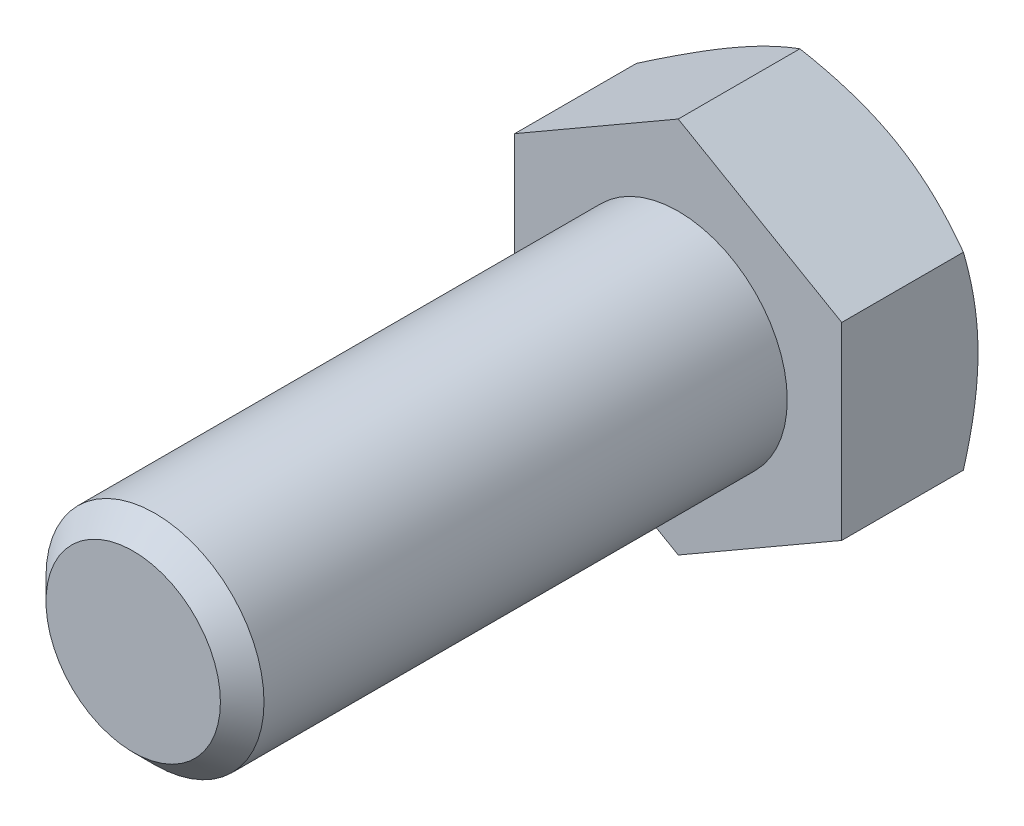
ISO-10303-21;
HEADER;
FILE_DESCRIPTION(('STEP AP214'),'2;1');
FILE_NAME('part.step','',(''),(''),'','','');
FILE_SCHEMA(('AUTOMOTIVE_DESIGN { 1 0 10303 214 1 1 1 1 }'));
ENDSEC;
DATA;
#1=APPLICATION_CONTEXT('core data for automotive mechanical design processes');
#2=APPLICATION_PROTOCOL_DEFINITION('international standard','automotive_design',2000,#1);
#3=PRODUCT_CONTEXT('',#1,'mechanical');
#4=PRODUCT('Part','Part','',(#3));
#5=PRODUCT_RELATED_PRODUCT_CATEGORY('part','',(#4));
#6=PRODUCT_DEFINITION_FORMATION('','',#4);
#7=PRODUCT_DEFINITION_CONTEXT('part definition',#1,'design');
#8=PRODUCT_DEFINITION('design','',#6,#7);
#9=PRODUCT_DEFINITION_SHAPE('','',#8);
#10=(LENGTH_UNIT() NAMED_UNIT(*) SI_UNIT(.MILLI.,.METRE.));
#11=(NAMED_UNIT(*) PLANE_ANGLE_UNIT() SI_UNIT($,.RADIAN.));
#12=(NAMED_UNIT(*) SI_UNIT($,.STERADIAN.) SOLID_ANGLE_UNIT());
#13=UNCERTAINTY_MEASURE_WITH_UNIT(LENGTH_MEASURE(1.E-05),#10,'distance_accuracy_value','');
#14=(GEOMETRIC_REPRESENTATION_CONTEXT(3) GLOBAL_UNCERTAINTY_ASSIGNED_CONTEXT((#13)) GLOBAL_UNIT_ASSIGNED_CONTEXT((#10,
#11,#12)) REPRESENTATION_CONTEXT('',''));
#15=CARTESIAN_POINT('',(0.,0.,0.));
#16=DIRECTION('',(0.,0.,1.));
#17=DIRECTION('',(1.,0.,0.));
#18=AXIS2_PLACEMENT_3D('',#15,#16,#17);
#19=CARTESIAN_POINT('',(-1.17961196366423E-13,3.05311331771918E-13,39.9999999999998));
#20=DIRECTION('',(0.,0.,0.999999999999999));
#21=DIRECTION('',(1.,0.,0.));
#22=AXIS2_PLACEMENT_3D('',#19,#20,#21);
#23=PLANE('',#22);
#24=CARTESIAN_POINT('',(-1.17961196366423E-13,3.05311331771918E-13,39.9999999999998));
#25=DIRECTION('',(0.,0.,0.999999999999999));
#26=DIRECTION('',(1.,0.,0.));
#27=AXIS2_PLACEMENT_3D('',#24,#25,#26);
#28=CIRCLE('',#27,6.4);
#29=CARTESIAN_POINT('',(6.3999999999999,3.13837844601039E-13,39.9999999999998));
#30=VERTEX_POINT('',#29);
#31=EDGE_CURVE('E206',#30,#30,#28,.T.);
#32=ORIENTED_EDGE('',*,*,#31,.T.);
#33=EDGE_LOOP('',(#32));
#34=FACE_BOUND('',#33,.T.);
#35=ADVANCED_FACE('F32',(#34),#23,.T.);
#36=CARTESIAN_POINT('',(0.,0.,0.));
#37=DIRECTION('',(0.,0.,0.999999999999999));
#38=DIRECTION('',(1.,0.,0.));
#39=AXIS2_PLACEMENT_3D('',#36,#37,#38);
#40=CYLINDRICAL_SURFACE('',#39,8.);
#41=CARTESIAN_POINT('',(0.,3.60822483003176E-13,38.3999999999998));
#42=DIRECTION('',(0.,0.,0.999999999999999));
#43=DIRECTION('',(1.,0.,0.));
#44=AXIS2_PLACEMENT_3D('',#41,#42,#43);
#45=CIRCLE('',#44,8.);
#46=CARTESIAN_POINT('',(8.,0.,38.3999999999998));
#47=VERTEX_POINT('',#46);
#48=EDGE_CURVE('E208',#47,#47,#45,.F.);
#49=CARTESIAN_POINT('',(0.,0.,0.));
#50=DIRECTION('',(0.,0.,0.999999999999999));
#51=DIRECTION('',(1.,0.,0.));
#52=AXIS2_PLACEMENT_3D('',#49,#50,#51);
#53=CIRCLE('',#52,8.);
#54=CARTESIAN_POINT('',(8.00000000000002,0.,0.));
#55=VERTEX_POINT('',#54);
#56=EDGE_CURVE('E209',#55,#55,#53,.F.);
#57=CARTESIAN_POINT('',(8.,0.,38.3999999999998));
#58=CARTESIAN_POINT('',(8.,0.,37.9999999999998));
#59=CARTESIAN_POINT('',(8.,0.,37.5999999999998));
#60=CARTESIAN_POINT('',(8.,0.,36.7999999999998));
#61=CARTESIAN_POINT('',(8.,0.,36.3999999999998));
#62=CARTESIAN_POINT('',(8.,0.,35.5999999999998));
#63=CARTESIAN_POINT('',(8.,0.,35.1999999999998));
#64=CARTESIAN_POINT('',(8.,0.,34.3999999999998));
#65=CARTESIAN_POINT('',(8.,0.,33.9999999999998));
#66=CARTESIAN_POINT('',(8.,0.,33.1999999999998));
#67=CARTESIAN_POINT('',(8.,0.,32.7999999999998));
#68=CARTESIAN_POINT('',(8.,0.,31.9999999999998));
#69=CARTESIAN_POINT('',(8.,0.,31.5999999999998));
#70=CARTESIAN_POINT('',(8.,0.,30.7999999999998));
#71=CARTESIAN_POINT('',(8.,0.,30.3999999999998));
#72=CARTESIAN_POINT('',(8.,0.,29.5999999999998));
#73=CARTESIAN_POINT('',(8.,0.,29.1999999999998));
#74=CARTESIAN_POINT('',(8.,0.,28.3999999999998));
#75=CARTESIAN_POINT('',(8.00000000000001,0.,27.9999999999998));
#76=CARTESIAN_POINT('',(8.00000000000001,0.,27.1999999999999));
#77=CARTESIAN_POINT('',(8.00000000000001,0.,26.7999999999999));
#78=CARTESIAN_POINT('',(8.00000000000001,0.,25.9999999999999));
#79=CARTESIAN_POINT('',(8.00000000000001,0.,25.5999999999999));
#80=CARTESIAN_POINT('',(8.00000000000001,0.,24.7999999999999));
#81=CARTESIAN_POINT('',(8.00000000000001,0.,24.3999999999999));
#82=CARTESIAN_POINT('',(8.00000000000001,0.,23.5999999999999));
#83=CARTESIAN_POINT('',(8.00000000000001,0.,23.1999999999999));
#84=CARTESIAN_POINT('',(8.00000000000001,0.,22.3999999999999));
#85=CARTESIAN_POINT('',(8.00000000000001,0.,21.9999999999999));
#86=CARTESIAN_POINT('',(8.00000000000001,0.,21.1999999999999));
#87=CARTESIAN_POINT('',(8.00000000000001,0.,20.7999999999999));
#88=CARTESIAN_POINT('',(8.00000000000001,0.,19.9999999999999));
#89=CARTESIAN_POINT('',(8.00000000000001,0.,19.5999999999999));
#90=CARTESIAN_POINT('',(8.00000000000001,0.,18.7999999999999));
#91=CARTESIAN_POINT('',(8.00000000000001,0.,18.3999999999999));
#92=CARTESIAN_POINT('',(8.00000000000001,0.,17.5999999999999));
#93=CARTESIAN_POINT('',(8.00000000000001,0.,17.1999999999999));
#94=CARTESIAN_POINT('',(8.00000000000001,0.,16.3999999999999));
#95=CARTESIAN_POINT('',(8.00000000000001,0.,15.9999999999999));
#96=CARTESIAN_POINT('',(8.00000000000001,0.,15.1999999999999));
#97=CARTESIAN_POINT('',(8.00000000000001,0.,14.7999999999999));
#98=CARTESIAN_POINT('',(8.00000000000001,0.,13.9999999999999));
#99=CARTESIAN_POINT('',(8.00000000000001,0.,13.5999999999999));
#100=CARTESIAN_POINT('',(8.00000000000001,0.,12.7999999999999));
#101=CARTESIAN_POINT('',(8.00000000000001,0.,12.3999999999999));
#102=CARTESIAN_POINT('',(8.00000000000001,0.,11.5999999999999));
#103=CARTESIAN_POINT('',(8.00000000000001,0.,11.1999999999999));
#104=CARTESIAN_POINT('',(8.00000000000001,0.,10.4));
#105=CARTESIAN_POINT('',(8.00000000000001,0.,9.99999999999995));
#106=CARTESIAN_POINT('',(8.00000000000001,0.,9.19999999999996));
#107=CARTESIAN_POINT('',(8.00000000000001,0.,8.79999999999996));
#108=CARTESIAN_POINT('',(8.00000000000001,0.,7.99999999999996));
#109=CARTESIAN_POINT('',(8.00000000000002,0.,7.59999999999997));
#110=CARTESIAN_POINT('',(8.00000000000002,0.,6.79999999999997));
#111=CARTESIAN_POINT('',(8.00000000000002,0.,6.39999999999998));
#112=CARTESIAN_POINT('',(8.00000000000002,0.,5.59999999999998));
#113=CARTESIAN_POINT('',(8.00000000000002,0.,5.19999999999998));
#114=CARTESIAN_POINT('',(8.00000000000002,0.,4.39999999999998));
#115=CARTESIAN_POINT('',(8.00000000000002,0.,3.99999999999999));
#116=CARTESIAN_POINT('',(8.00000000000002,0.,3.19999999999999));
#117=CARTESIAN_POINT('',(8.00000000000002,0.,2.8));
#118=CARTESIAN_POINT('',(8.00000000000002,0.,2.));
#119=CARTESIAN_POINT('',(8.00000000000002,0.,1.6));
#120=CARTESIAN_POINT('',(8.00000000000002,0.,0.800000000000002));
#121=CARTESIAN_POINT('',(8.00000000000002,0.,0.400000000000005));
#122=CARTESIAN_POINT('',(8.00000000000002,0.,0.));
#123=B_SPLINE_CURVE_WITH_KNOTS('',3,(#57,#58,#59,#60,#61,#62,#63,#64,#65,#66,#67,#68,#69,#70,
#71,#72,#73,#74,#75,#76,#77,#78,#79,#80,#81,#82,#83,#84,#85,#86,#87,#88,#89,#90,#91,#92,#93,#94,
#95,#96,#97,#98,#99,#100,#101,#102,#103,#104,#105,#106,#107,#108,#109,#110,#111,#112,#113,#114,
#115,#116,#117,#118,#119,#120,#121,#122),.UNSPECIFIED.,.F.,.F.,(4,2,2,2,2,2,2,2,2,2,2,2,2,2,2,2,
2,2,2,2,2,2,2,2,2,2,2,2,2,2,2,2,4),(0.,1.19999999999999,2.39999999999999,3.59999999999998,
4.79999999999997,5.99999999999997,7.19999999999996,8.39999999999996,9.59999999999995,
10.7999999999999,11.9999999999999,13.1999999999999,14.3999999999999,15.5999999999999,
16.7999999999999,17.9999999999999,19.1999999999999,20.3999999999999,21.5999999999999,
22.7999999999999,23.9999999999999,25.1999999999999,26.3999999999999,27.5999999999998,
28.7999999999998,29.9999999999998,31.1999999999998,32.3999999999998,33.5999999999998,
34.7999999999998,35.9999999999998,37.1999999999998,38.3999999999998),.UNSPECIFIED.);
#124=EDGE_CURVE('BSEAM197',#47,#55,#123,.T.);
#125=ORIENTED_EDGE('',*,*,#48,.T.);
#126=ORIENTED_EDGE('',*,*,#56,.F.);
#127=ORIENTED_EDGE('',*,*,#124,.T.);
#128=ORIENTED_EDGE('',*,*,#124,.F.);
#129=EDGE_LOOP('',(#125,#127,#126,#128));
#130=FACE_BOUND('',#129,.T.);
#131=ADVANCED_FACE('F197',(#130),#40,.T.);
#132=CARTESIAN_POINT('',(-1.17961196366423E-13,3.05311331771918E-13,39.9999999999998));
#133=DIRECTION('',(0.,0.,-0.999999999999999));
#134=DIRECTION('',(-1.,0.,0.));
#135=AXIS2_PLACEMENT_3D('',#132,#133,#134);
#136=CONICAL_SURFACE('',#135,6.4,0.785398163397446);
#137=ORIENTED_EDGE('',*,*,#48,.F.);
#138=EDGE_LOOP('',(#137));
#139=FACE_BOUND('',#138,.T.);
#140=ORIENTED_EDGE('',*,*,#31,.F.);
#141=EDGE_LOOP('',(#140));
#142=FACE_BOUND('',#141,.T.);
#143=ADVANCED_FACE('F202',(#139,#142),#136,.T.);
#144=CARTESIAN_POINT('',(2.15105711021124E-13,13.856406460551,-10.0000000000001));
#145=DIRECTION('',(0.5,0.866025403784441,0.));
#146=DIRECTION('',(-0.866025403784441,0.499999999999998,0.));
#147=AXIS2_PLACEMENT_3D('',#144,#145,#146);
#148=PLANE('',#147);
#149=CARTESIAN_POINT('',(-0.000199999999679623,13.8565219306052,-8.92813656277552));
#150=CARTESIAN_POINT('',(0.26358579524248,13.7042251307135,-9.01605036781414));
#151=CARTESIAN_POINT('',(0.528355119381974,13.5513604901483,-9.09997400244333));
#152=CARTESIAN_POINT('',(1.0600170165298,13.244405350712,-9.25873378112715));
#153=CARTESIAN_POINT('',(1.32691025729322,13.0903144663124,-9.33356693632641));
#154=CARTESIAN_POINT('',(2.13189040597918,12.6255589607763,-9.54298246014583));
#155=CARTESIAN_POINT('',(2.67315507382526,12.3130596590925,-9.66209676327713));
#156=CARTESIAN_POINT('',(3.48313282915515,11.8454187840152,-9.80176893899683));
#157=CARTESIAN_POINT('',(3.74942610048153,11.6916742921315,-9.84155620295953));
#158=CARTESIAN_POINT('',(4.283245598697,11.3834734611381,-9.90827663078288));
#159=CARTESIAN_POINT('',(4.55077184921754,11.2290171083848,-9.9352095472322));
#160=CARTESIAN_POINT('',(5.08627036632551,10.9198468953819,-9.97553140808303));
#161=CARTESIAN_POINT('',(5.35424172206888,10.7651335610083,-9.98893644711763));
#162=CARTESIAN_POINT('',(5.89043273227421,10.4555635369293,-10.0019169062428));
#163=CARTESIAN_POINT('',(6.15865237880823,10.3007068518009,-10.0014927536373));
#164=CARTESIAN_POINT('',(6.6600893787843,10.0112020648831,-9.98777998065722));
#165=CARTESIAN_POINT('',(6.89334249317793,9.87653331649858,-9.97616401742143));
#166=CARTESIAN_POINT('',(7.35931224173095,9.60750555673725,-9.94269199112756));
#167=CARTESIAN_POINT('',(7.59202883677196,9.47314656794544,-9.92083520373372));
#168=CARTESIAN_POINT('',(8.05679907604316,9.2048113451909,-9.86726258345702));
#169=CARTESIAN_POINT('',(8.28885201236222,9.07083551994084,-9.835538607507));
#170=CARTESIAN_POINT('',(8.75186996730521,8.80351197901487,-9.76278822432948));
#171=CARTESIAN_POINT('',(8.98283491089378,8.67016430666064,-9.72176118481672));
#172=CARTESIAN_POINT('',(9.68394195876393,8.26537996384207,-9.5836883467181));
#173=CARTESIAN_POINT('',(10.1520537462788,7.99511549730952,-9.47287511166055));
#174=CARTESIAN_POINT('',(11.0812971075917,7.45861659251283,-9.221374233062));
#175=CARTESIAN_POINT('',(11.5424405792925,7.19237528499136,-9.08074565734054));
#176=CARTESIAN_POINT('',(12.0002000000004,6.92808776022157,-8.92813656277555));
#177=B_SPLINE_CURVE_WITH_KNOTS('',3,(#149,#150,#151,#152,#153,#154,#155,#156,#157,#158,#159,
#160,#161,#162,#163,#164,#165,#166,#167,#168,#169,#170,#171,#172,#173,#174,#175,#176),
.UNSPECIFIED.,.F.,.F.,(4,2,2,2,2,2,2,2,2,2,2,2,2,4),(0.,0.95100487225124,1.90232158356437,
3.80900466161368,4.73894551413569,5.66890426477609,6.59775529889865,7.52657763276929,
8.3351464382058,9.14377244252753,9.95306755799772,10.7624176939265,12.4167102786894,
14.0677556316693),.UNSPECIFIED.);
#178=CARTESIAN_POINT('',(2.15105711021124E-13,13.856406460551,-8.92820323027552));
#179=VERTEX_POINT('',#178);
#180=CARTESIAN_POINT('',(6.00000000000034,10.3923048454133,-10.));
#181=VERTEX_POINT('',#180);
#182=EDGE_CURVE('E242',#179,#181,#177,.T.);
#183=ORIENTED_EDGE('',*,*,#182,.F.);
#184=DIRECTION('',(0.,0.,0.999999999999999));
#185=VECTOR('',#184,1.);
#186=CARTESIAN_POINT('',(2.15105711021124E-13,13.856406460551,-10.0000000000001));
#187=LINE('',#186,#185);
#188=CARTESIAN_POINT('',(2.18575157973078E-13,13.856406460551,0.));
#189=VERTEX_POINT('',#188);
#190=EDGE_CURVE('E216',#179,#189,#187,.T.);
#191=ORIENTED_EDGE('',*,*,#190,.T.);
#192=DIRECTION('',(-0.866025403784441,0.499999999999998,0.));
#193=VECTOR('',#192,1.);
#194=CARTESIAN_POINT('',(2.18575157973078E-13,13.856406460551,0.));
#195=LINE('',#194,#193);
#196=CARTESIAN_POINT('',(12.0000000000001,6.9282032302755,0.));
#197=VERTEX_POINT('',#196);
#198=EDGE_CURVE('E240',#197,#189,#195,.T.);
#199=ORIENTED_EDGE('',*,*,#198,.F.);
#200=DIRECTION('',(0.,0.,0.999999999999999));
#201=VECTOR('',#200,1.);
#202=CARTESIAN_POINT('',(12.0000000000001,6.92820323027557,-10.0000000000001));
#203=LINE('',#202,#201);
#204=CARTESIAN_POINT('',(12.0000000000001,6.92820323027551,-8.92820323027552));
#205=VERTEX_POINT('',#204);
#206=EDGE_CURVE('E213',#205,#197,#203,.T.);
#207=ORIENTED_EDGE('',*,*,#206,.F.);
#208=EDGE_CURVE('E172',#181,#205,#177,.T.);
#209=ORIENTED_EDGE('',*,*,#208,.F.);
#210=EDGE_LOOP('',(#183,#191,#199,#207,#209));
#211=FACE_BOUND('',#210,.T.);
#212=ADVANCED_FACE('F182',(#211),#148,.T.);
#213=CARTESIAN_POINT('',(12.0000000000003,-6.92820323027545,-10.0000000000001));
#214=DIRECTION('',(1.,0.,0.));
#215=DIRECTION('',(0.,0.,-0.999999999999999));
#216=AXIS2_PLACEMENT_3D('',#213,#214,#215);
#217=PLANE('',#216);
#218=CARTESIAN_POINT('',(12.0000000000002,-18.9250739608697,-3.99042361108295));
#219=CARTESIAN_POINT('',(12.0000000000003,-18.6616294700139,-4.11887459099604));
#220=CARTESIAN_POINT('',(12.0000000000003,-18.3978841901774,-4.24670838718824));
#221=CARTESIAN_POINT('',(12.0000000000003,-17.869729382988,-4.50100240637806));
#222=CARTESIAN_POINT('',(12.0000000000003,-17.6053198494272,-4.62746261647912));
#223=CARTESIAN_POINT('',(12.0000000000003,-16.8109346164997,-5.00460542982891));
#224=CARTESIAN_POINT('',(12.0000000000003,-16.279875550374,-5.25301439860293));
#225=CARTESIAN_POINT('',(12.0000000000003,-15.2115652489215,-5.74359590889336));
#226=CARTESIAN_POINT('',(12.0000000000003,-14.6742962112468,-5.98572977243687));
#227=CARTESIAN_POINT('',(12.0000000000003,-13.5955935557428,-6.46050256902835));
#228=CARTESIAN_POINT('',(12.0000000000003,-13.0541601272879,-6.69314193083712));
#229=CARTESIAN_POINT('',(12.0000000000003,-11.947755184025,-7.15413664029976));
#230=CARTESIAN_POINT('',(12.0000000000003,-11.3826097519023,-7.38207667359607));
#231=CARTESIAN_POINT('',(12.0000000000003,-10.2458209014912,-7.82145679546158));
#232=CARTESIAN_POINT('',(12.0000000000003,-9.6741767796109,-8.03289507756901));
#233=CARTESIAN_POINT('',(12.0000000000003,-8.52447018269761,-8.43394793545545));
#234=CARTESIAN_POINT('',(12.0000000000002,-7.94642231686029,-8.62360406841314));
#235=CARTESIAN_POINT('',(12.0000000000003,-6.7819879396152,-8.97522909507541));
#236=CARTESIAN_POINT('',(12.0000000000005,-6.19560401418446,-9.13720638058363));
#237=CARTESIAN_POINT('',(12.0000000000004,-5.31125301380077,-9.35327296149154));
#238=CARTESIAN_POINT('',(12.0000000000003,-5.01651684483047,-9.42065839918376));
#239=CARTESIAN_POINT('',(12.0000000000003,-4.42497462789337,-9.54568693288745));
#240=CARTESIAN_POINT('',(12.0000000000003,-4.12816861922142,-9.60333021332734));
#241=CARTESIAN_POINT('',(12.0000000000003,-3.5326697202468,-9.70787722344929));
#242=CARTESIAN_POINT('',(12.0000000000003,-3.23397688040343,-9.75478123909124));
#243=CARTESIAN_POINT('',(12.0000000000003,-2.63499315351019,-9.83692742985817));
#244=CARTESIAN_POINT('',(12.0000000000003,-2.33470233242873,-9.87217008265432));
#245=CARTESIAN_POINT('',(12.0000000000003,-1.73700046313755,-9.92983318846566));
#246=CARTESIAN_POINT('',(12.0000000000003,-1.43960568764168,-9.95242127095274));
#247=CARTESIAN_POINT('',(12.0000000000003,-0.844126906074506,-9.98498816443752));
#248=CARTESIAN_POINT('',(12.0000000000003,-0.546042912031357,-9.99496719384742));
#249=CARTESIAN_POINT('',(12.0000000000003,0.050282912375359,-10.0020768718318));
#250=CARTESIAN_POINT('',(12.0000000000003,0.348524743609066,-9.99920744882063));
#251=CARTESIAN_POINT('',(12.0000000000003,0.944614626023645,-9.98069357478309));
#252=CARTESIAN_POINT('',(12.0000000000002,1.24246265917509,-9.96504855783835));
#253=CARTESIAN_POINT('',(12.0000000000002,1.94883669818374,-9.91313385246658));
#254=CARTESIAN_POINT('',(12.0000000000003,2.35696532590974,-9.87132867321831));
#255=CARTESIAN_POINT('',(12.0000000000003,3.17037872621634,-9.76594124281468));
#256=CARTESIAN_POINT('',(12.0000000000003,3.5756631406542,-9.70235629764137));
#257=CARTESIAN_POINT('',(12.0000000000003,4.78667114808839,-9.4822885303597));
#258=CARTESIAN_POINT('',(12.0000000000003,5.58715478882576,-9.2965257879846));
#259=CARTESIAN_POINT('',(12.0000000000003,6.78477534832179,-8.97197381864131));
#260=CARTESIAN_POINT('',(12.0000000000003,7.18805346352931,-8.85452170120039));
#261=CARTESIAN_POINT('',(12.0000000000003,7.9906989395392,-8.60681919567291));
#262=CARTESIAN_POINT('',(12.0000000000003,8.39006626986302,-8.47656870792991));
#263=CARTESIAN_POINT('',(12.0000000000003,9.18500745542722,-8.20540698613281));
#264=CARTESIAN_POINT('',(12.0000000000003,9.58058232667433,-8.06449870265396));
#265=CARTESIAN_POINT('',(12.0000000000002,10.368415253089,-7.77374558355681));
#266=CARTESIAN_POINT('',(12.0000000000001,10.7606733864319,-7.6239009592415));
#267=CARTESIAN_POINT('',(12.0000000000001,11.4875161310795,-7.33823544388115));
#268=CARTESIAN_POINT('',(12.0000000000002,11.8224853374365,-7.20338895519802));
#269=CARTESIAN_POINT('',(12.0000000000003,12.4904657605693,-6.92892402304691));
#270=CARTESIAN_POINT('',(12.0000000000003,12.8234769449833,-6.78930550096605));
#271=CARTESIAN_POINT('',(12.0000000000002,13.8199414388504,-6.3642746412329));
#272=CARTESIAN_POINT('',(12.0000000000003,14.4807713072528,-6.07270863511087));
#273=CARTESIAN_POINT('',(12.0000000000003,15.7970784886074,-5.47713534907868));
#274=CARTESIAN_POINT('',(12.0000000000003,16.4525535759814,-5.17312318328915));
#275=CARTESIAN_POINT('',(12.0000000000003,17.7589886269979,-4.55563924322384));
#276=CARTESIAN_POINT('',(12.0000000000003,18.4099487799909,-4.24216786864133));
#277=CARTESIAN_POINT('',(12.0000000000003,19.7093218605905,-3.6073241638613));
#278=CARTESIAN_POINT('',(12.0000000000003,20.3577288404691,-3.2859396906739));
#279=CARTESIAN_POINT('',(12.0000000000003,21.6516057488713,-2.63730730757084));
#280=CARTESIAN_POINT('',(12.0000000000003,22.2970756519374,-2.3100593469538));
#281=CARTESIAN_POINT('',(12.0000000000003,23.5854613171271,-1.65093387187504));
#282=CARTESIAN_POINT('',(12.0000000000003,24.2283776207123,-1.31905741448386));
#283=CARTESIAN_POINT('',(12.0000000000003,25.5122149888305,-0.651476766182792));
#284=CARTESIAN_POINT('',(12.0000000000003,26.1531360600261,-0.315772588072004));
#285=CARTESIAN_POINT('',(12.0000000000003,27.9362828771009,0.623783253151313));
#286=CARTESIAN_POINT('',(12.0000000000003,29.0767003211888,1.23106608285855));
#287=CARTESIAN_POINT('',(12.0000000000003,31.3537253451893,2.4528894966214));
#288=CARTESIAN_POINT('',(12.0000000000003,32.4903326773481,3.06743054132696));
#289=CARTESIAN_POINT('',(12.0000000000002,34.7567241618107,4.29980771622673));
#290=CARTESIAN_POINT('',(12.0000000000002,35.8865183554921,4.91762539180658));
#291=CARTESIAN_POINT('',(12.0000000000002,37.5794668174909,5.84741408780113));
#292=CARTESIAN_POINT('',(12.0000000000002,38.1434699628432,6.15784153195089));
#293=CARTESIAN_POINT('',(12.0000000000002,39.270971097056,6.77961088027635));
#294=CARTESIAN_POINT('',(12.0000000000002,39.834469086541,7.09095278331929));
#295=CARTESIAN_POINT('',(12.0000000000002,40.3977455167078,7.40269511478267));
#296=B_SPLINE_CURVE_WITH_KNOTS('',3,(#218,#219,#220,#221,#222,#223,#224,#225,#226,#227,#228,
#229,#230,#231,#232,#233,#234,#235,#236,#237,#238,#239,#240,#241,#242,#243,#244,#245,#246,#247,
#248,#249,#250,#251,#252,#253,#254,#255,#256,#257,#258,#259,#260,#261,#262,#263,#264,#265,#266,
#267,#268,#269,#270,#271,#272,#273,#274,#275,#276,#277,#278,#279,#280,#281,#282,#283,#284,#285,
#286,#287,#288,#289,#290,#291,#292,#293,#294,#295),.UNSPECIFIED.,.F.,.F.,(4,2,2,2,2,2,2,2,2,2,2,
2,2,2,2,2,2,2,2,2,2,2,2,2,2,2,2,2,2,2,2,2,2,2,2,2,2,2,4),(0.,0.879273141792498,1.75855453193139,
3.5173619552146,5.28522162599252,7.05300137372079,8.88094951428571,10.7090974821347,
12.5336975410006,14.3577434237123,15.2646321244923,16.1715036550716,17.07835103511,
17.985161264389,18.8796567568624,19.7741367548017,20.668621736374,21.5631463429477,
22.793250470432,24.02350680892,26.4852023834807,27.7451892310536,29.0051858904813,
30.2648349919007,31.5244543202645,32.6076922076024,33.6909479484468,35.8576349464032,
38.0251808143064,40.1926352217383,42.3636532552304,44.5346900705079,46.7052389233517,
48.8757805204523,52.7518329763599,56.6281327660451,60.4911769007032,62.4225443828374,
64.3539094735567),.UNSPECIFIED.);
#297=CARTESIAN_POINT('',(12.0000000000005,0.,-10.));
#298=VERTEX_POINT('',#297);
#299=EDGE_CURVE('E170',#205,#298,#296,.F.);
#300=ORIENTED_EDGE('',*,*,#299,.F.);
#301=ORIENTED_EDGE('',*,*,#206,.T.);
#302=DIRECTION('',(0.,1.,0.));
#303=VECTOR('',#302,1.);
#304=CARTESIAN_POINT('',(12.0000000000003,-6.92820323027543,0.));
#305=LINE('',#304,#303);
#306=CARTESIAN_POINT('',(12.0000000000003,-6.92820323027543,0.));
#307=VERTEX_POINT('',#306);
#308=EDGE_CURVE('E218',#307,#197,#305,.T.);
#309=ORIENTED_EDGE('',*,*,#308,.F.);
#310=DIRECTION('',(0.,0.,0.999999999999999));
#311=VECTOR('',#310,1.);
#312=CARTESIAN_POINT('',(12.0000000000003,-6.92820323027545,-10.0000000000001));
#313=LINE('',#312,#311);
#314=CARTESIAN_POINT('',(12.0000000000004,-6.92820323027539,-8.92820323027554));
#315=VERTEX_POINT('',#314);
#316=EDGE_CURVE('E224',#315,#307,#313,.T.);
#317=ORIENTED_EDGE('',*,*,#316,.F.);
#318=EDGE_CURVE('E165',#298,#315,#296,.F.);
#319=ORIENTED_EDGE('',*,*,#318,.F.);
#320=EDGE_LOOP('',(#300,#301,#309,#317,#319));
#321=FACE_BOUND('',#320,.T.);
#322=ADVANCED_FACE('F178',(#321),#217,.T.);
#323=CARTESIAN_POINT('',(2.70616862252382E-13,-13.856406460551,-10.0000000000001));
#324=DIRECTION('',(0.499999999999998,-0.86602540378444,0.));
#325=DIRECTION('',(0.866025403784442,0.5,0.));
#326=AXIS2_PLACEMENT_3D('',#323,#324,#325);
#327=PLANE('',#326);
#328=CARTESIAN_POINT('',(12.0002000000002,-6.92808776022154,-8.92813656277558));
#329=CARTESIAN_POINT('',(11.736414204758,-7.08038456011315,-9.01605036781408));
#330=CARTESIAN_POINT('',(11.4716448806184,-7.2332492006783,-9.09997400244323));
#331=CARTESIAN_POINT('',(10.9399829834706,-7.54020434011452,-9.25873378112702));
#332=CARTESIAN_POINT('',(10.6730897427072,-7.69429522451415,-9.33356693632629));
#333=CARTESIAN_POINT('',(9.86810959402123,-8.15905073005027,-9.54298246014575));
#334=CARTESIAN_POINT('',(9.32684492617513,-8.47155003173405,-9.66209676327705));
#335=CARTESIAN_POINT('',(8.51686717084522,-8.93919090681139,-9.80176893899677));
#336=CARTESIAN_POINT('',(8.25057389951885,-9.09293539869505,-9.84155620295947));
#337=CARTESIAN_POINT('',(7.71675440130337,-9.40113622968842,-9.90827663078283));
#338=CARTESIAN_POINT('',(7.44922815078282,-9.55559258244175,-9.93520954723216));
#339=CARTESIAN_POINT('',(6.91372963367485,-9.86476279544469,-9.975531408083));
#340=CARTESIAN_POINT('',(6.64575827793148,-10.0194761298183,-9.98893644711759));
#341=CARTESIAN_POINT('',(6.10956726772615,-10.3290461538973,-10.0019169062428));
#342=CARTESIAN_POINT('',(5.84134762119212,-10.4839028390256,-10.0014927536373));
#343=CARTESIAN_POINT('',(5.33991062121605,-10.7734076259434,-9.98777998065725));
#344=CARTESIAN_POINT('',(5.10665750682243,-10.908076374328,-9.97616401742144));
#345=CARTESIAN_POINT('',(4.64068775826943,-11.1771041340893,-9.94269199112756));
#346=CARTESIAN_POINT('',(4.40797116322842,-11.3114631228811,-9.92083520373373));
#347=CARTESIAN_POINT('',(3.94320092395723,-11.5797983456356,-9.86726258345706));
#348=CARTESIAN_POINT('',(3.71114798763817,-11.7137741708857,-9.83553860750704));
#349=CARTESIAN_POINT('',(3.24813003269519,-11.9810977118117,-9.76278822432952));
#350=CARTESIAN_POINT('',(3.01716508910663,-12.1144453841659,-9.72176118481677));
#351=CARTESIAN_POINT('',(2.31605804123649,-12.5192297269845,-9.58368834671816));
#352=CARTESIAN_POINT('',(1.84794625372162,-12.789494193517,-9.47287511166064));
#353=CARTESIAN_POINT('',(0.918702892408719,-13.3259930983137,-9.22137423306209));
#354=CARTESIAN_POINT('',(0.457559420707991,-13.5922344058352,-9.08074565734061));
#355=CARTESIAN_POINT('',(-0.000199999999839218,-13.856521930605,-8.92813656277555));
#356=B_SPLINE_CURVE_WITH_KNOTS('',3,(#328,#329,#330,#331,#332,#333,#334,#335,#336,#337,#338,
#339,#340,#341,#342,#343,#344,#345,#346,#347,#348,#349,#350,#351,#352,#353,#354,#355),
.UNSPECIFIED.,.F.,.F.,(4,2,2,2,2,2,2,2,2,2,2,2,2,4),(0.,0.951004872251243,1.90232158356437,
3.80900466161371,4.73894551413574,5.66890426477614,6.59775529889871,7.52657763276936,
8.33514643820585,9.14377244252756,9.95306755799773,10.7624176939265,12.4167102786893,
14.0677556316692),.UNSPECIFIED.);
#357=CARTESIAN_POINT('',(6.00000000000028,-10.3923048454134,-10.0000000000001));
#358=VERTEX_POINT('',#357);
#359=EDGE_CURVE('E171',#315,#358,#356,.T.);
#360=ORIENTED_EDGE('',*,*,#359,.F.);
#361=ORIENTED_EDGE('',*,*,#316,.T.);
#362=DIRECTION('',(0.866025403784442,0.499999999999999,0.));
#363=VECTOR('',#362,1.);
#364=CARTESIAN_POINT('',(2.77555756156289E-13,-13.856406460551,0.));
#365=LINE('',#364,#363);
#366=CARTESIAN_POINT('',(2.77555756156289E-13,-13.856406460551,0.));
#367=VERTEX_POINT('',#366);
#368=EDGE_CURVE('E229',#367,#307,#365,.T.);
#369=ORIENTED_EDGE('',*,*,#368,.F.);
#370=DIRECTION('',(0.,0.,0.999999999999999));
#371=VECTOR('',#370,1.);
#372=CARTESIAN_POINT('',(2.70616862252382E-13,-13.856406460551,-10.0000000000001));
#373=LINE('',#372,#371);
#374=CARTESIAN_POINT('',(2.84494650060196E-13,-13.856406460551,-8.92820323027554));
#375=VERTEX_POINT('',#374);
#376=EDGE_CURVE('E222',#375,#367,#373,.T.);
#377=ORIENTED_EDGE('',*,*,#376,.F.);
#378=EDGE_CURVE('E159',#358,#375,#356,.T.);
#379=ORIENTED_EDGE('',*,*,#378,.F.);
#380=EDGE_LOOP('',(#360,#361,#369,#377,#379));
#381=FACE_BOUND('',#380,.T.);
#382=ADVANCED_FACE('F181',(#381),#327,.T.);
#383=CARTESIAN_POINT('',(2.70616862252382E-13,-13.856406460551,-10.0000000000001));
#384=DIRECTION('',(-0.500000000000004,-0.866025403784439,0.));
#385=DIRECTION('',(0.866025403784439,-0.500000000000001,0.));
#386=AXIS2_PLACEMENT_3D('',#383,#384,#385);
#387=PLANE('',#386);
#388=CARTESIAN_POINT('',(0.000200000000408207,-13.8565219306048,-8.92813656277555));
#389=CARTESIAN_POINT('',(-0.263585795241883,-13.7042251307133,-9.01605036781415));
#390=CARTESIAN_POINT('',(-0.528355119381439,-13.5513604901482,-9.09997400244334));
#391=CARTESIAN_POINT('',(-1.06001701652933,-13.244405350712,-9.25873378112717));
#392=CARTESIAN_POINT('',(-1.32691025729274,-13.0903144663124,-9.33356693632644));
#393=CARTESIAN_POINT('',(-2.13189040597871,-12.6255589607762,-9.5429824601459));
#394=CARTESIAN_POINT('',(-2.67315507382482,-12.3130596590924,-9.66209676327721));
#395=CARTESIAN_POINT('',(-3.48313282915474,-11.8454187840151,-9.80176893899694));
#396=CARTESIAN_POINT('',(-3.74942610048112,-11.6916742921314,-9.84155620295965));
#397=CARTESIAN_POINT('',(-4.28324559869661,-11.383473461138,-9.90827663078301));
#398=CARTESIAN_POINT('',(-4.55077184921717,-11.2290171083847,-9.93520954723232));
#399=CARTESIAN_POINT('',(-5.08627036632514,-10.9198468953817,-9.9755314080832));
#400=CARTESIAN_POINT('',(-5.3542417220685,-10.7651335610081,-9.98893644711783));
#401=CARTESIAN_POINT('',(-5.89043273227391,-10.4555635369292,-10.0019169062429));
#402=CARTESIAN_POINT('',(-6.15865237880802,-10.300706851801,-10.0014927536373));
#403=CARTESIAN_POINT('',(-6.66008937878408,-10.0112020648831,-9.98777998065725));
#404=CARTESIAN_POINT('',(-6.89334249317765,-9.87653331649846,-9.97616401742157));
#405=CARTESIAN_POINT('',(-7.35931224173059,-9.60750555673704,-9.94269199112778));
#406=CARTESIAN_POINT('',(-7.59202883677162,-9.47314656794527,-9.92083520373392));
#407=CARTESIAN_POINT('',(-8.0567990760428,-9.20481134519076,-9.86726258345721));
#408=CARTESIAN_POINT('',(-8.28885201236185,-9.0708355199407,-9.8355386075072));
#409=CARTESIAN_POINT('',(-8.75186996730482,-8.80351197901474,-9.76278822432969));
#410=CARTESIAN_POINT('',(-8.98283491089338,-8.67016430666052,-9.72176118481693));
#411=CARTESIAN_POINT('',(-9.6839419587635,-8.26537996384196,-9.58368834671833));
#412=CARTESIAN_POINT('',(-10.1520537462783,-7.9951154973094,-9.47287511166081));
#413=CARTESIAN_POINT('',(-11.0812971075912,-7.45861659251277,-9.22137423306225));
#414=CARTESIAN_POINT('',(-11.542440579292,-7.19237528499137,-9.08074565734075));
#415=CARTESIAN_POINT('',(-12.0001999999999,-6.92808776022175,-8.92813656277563));
#416=B_SPLINE_CURVE_WITH_KNOTS('',3,(#388,#389,#390,#391,#392,#393,#394,#395,#396,#397,#398,
#399,#400,#401,#402,#403,#404,#405,#406,#407,#408,#409,#410,#411,#412,#413,#414,#415),
.UNSPECIFIED.,.F.,.F.,(4,2,2,2,2,2,2,2,2,2,2,2,2,4),(0.,0.951004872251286,1.90232158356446,
3.80900466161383,4.73894551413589,5.66890426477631,6.59775529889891,7.52657763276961,
8.33514643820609,9.14377244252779,9.95306755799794,10.7624176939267,12.4167102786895,
14.0677556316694),.UNSPECIFIED.);
#417=CARTESIAN_POINT('',(-5.99999999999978,-10.3923048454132,-10.));
#418=VERTEX_POINT('',#417);
#419=EDGE_CURVE('E261',#375,#418,#416,.T.);
#420=ORIENTED_EDGE('',*,*,#419,.F.);
#421=ORIENTED_EDGE('',*,*,#376,.T.);
#422=DIRECTION('',(0.866025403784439,-0.500000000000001,0.));
#423=VECTOR('',#422,1.);
#424=CARTESIAN_POINT('',(2.77555756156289E-13,-13.856406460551,0.));
#425=LINE('',#424,#423);
#426=CARTESIAN_POINT('',(-11.9999999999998,-6.9282032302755,-1.38777878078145E-13));
#427=VERTEX_POINT('',#426);
#428=EDGE_CURVE('E232',#427,#367,#425,.T.);
#429=ORIENTED_EDGE('',*,*,#428,.F.);
#430=DIRECTION('',(0.,0.,0.999999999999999));
#431=VECTOR('',#430,1.);
#432=CARTESIAN_POINT('',(-11.9999999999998,-6.92820323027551,-10.0000000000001));
#433=LINE('',#432,#431);
#434=CARTESIAN_POINT('',(-11.9999999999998,-6.92820323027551,-8.92820323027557));
#435=VERTEX_POINT('',#434);
#436=EDGE_CURVE('E220',#435,#427,#433,.T.);
#437=ORIENTED_EDGE('',*,*,#436,.F.);
#438=EDGE_CURVE('E108',#418,#435,#416,.T.);
#439=ORIENTED_EDGE('',*,*,#438,.F.);
#440=EDGE_LOOP('',(#420,#421,#429,#437,#439));
#441=FACE_BOUND('',#440,.T.);
#442=ADVANCED_FACE('F186',(#441),#387,.T.);
#443=CARTESIAN_POINT('',(-11.9999999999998,-6.92820323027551,-10.0000000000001));
#444=DIRECTION('',(-1.,0.,0.));
#445=DIRECTION('',(0.,0.,0.999999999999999));
#446=AXIS2_PLACEMENT_3D('',#443,#444,#445);
#447=PLANE('',#446);
#448=CARTESIAN_POINT('',(-11.9999999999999,-18.9250739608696,-3.99042361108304));
#449=CARTESIAN_POINT('',(-11.9999999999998,-18.6616294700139,-4.11887459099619));
#450=CARTESIAN_POINT('',(-11.9999999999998,-18.3978841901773,-4.24670838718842));
#451=CARTESIAN_POINT('',(-11.9999999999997,-17.869729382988,-4.50100240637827));
#452=CARTESIAN_POINT('',(-11.9999999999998,-17.6053198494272,-4.62746261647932));
#453=CARTESIAN_POINT('',(-11.9999999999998,-16.8109346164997,-5.00460542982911));
#454=CARTESIAN_POINT('',(-11.9999999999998,-16.279875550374,-5.25301439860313));
#455=CARTESIAN_POINT('',(-11.9999999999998,-15.2115652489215,-5.74359590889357));
#456=CARTESIAN_POINT('',(-11.9999999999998,-14.6742962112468,-5.98572977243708));
#457=CARTESIAN_POINT('',(-11.9999999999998,-13.5955935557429,-6.46050256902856));
#458=CARTESIAN_POINT('',(-11.9999999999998,-13.0541601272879,-6.69314193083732));
#459=CARTESIAN_POINT('',(-11.9999999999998,-11.9477551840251,-7.15413664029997));
#460=CARTESIAN_POINT('',(-11.9999999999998,-11.3826097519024,-7.38207667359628));
#461=CARTESIAN_POINT('',(-11.9999999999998,-10.2458209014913,-7.82145679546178));
#462=CARTESIAN_POINT('',(-11.9999999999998,-9.67417677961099,-8.03289507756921));
#463=CARTESIAN_POINT('',(-11.9999999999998,-8.52447018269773,-8.43394793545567));
#464=CARTESIAN_POINT('',(-11.9999999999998,-7.94642231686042,-8.62360406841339));
#465=CARTESIAN_POINT('',(-11.9999999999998,-6.78198793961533,-8.97522909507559));
#466=CARTESIAN_POINT('',(-11.9999999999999,-6.19560401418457,-9.13720638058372));
#467=CARTESIAN_POINT('',(-11.9999999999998,-5.3112530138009,-9.3532729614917));
#468=CARTESIAN_POINT('',(-11.9999999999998,-5.01651684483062,-9.42065839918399));
#469=CARTESIAN_POINT('',(-11.9999999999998,-4.42497462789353,-9.54568693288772));
#470=CARTESIAN_POINT('',(-11.9999999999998,-4.12816861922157,-9.6033302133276));
#471=CARTESIAN_POINT('',(-11.9999999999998,-3.53266972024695,-9.70787722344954));
#472=CARTESIAN_POINT('',(-11.9999999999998,-3.23397688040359,-9.7547812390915));
#473=CARTESIAN_POINT('',(-11.9999999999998,-2.63499315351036,-9.83692742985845));
#474=CARTESIAN_POINT('',(-11.9999999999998,-2.3347023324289,-9.87217008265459));
#475=CARTESIAN_POINT('',(-11.9999999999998,-1.73700046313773,-9.92983318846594));
#476=CARTESIAN_POINT('',(-11.9999999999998,-1.43960568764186,-9.95242127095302));
#477=CARTESIAN_POINT('',(-11.9999999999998,-0.844126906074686,-9.9849881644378));
#478=CARTESIAN_POINT('',(-11.9999999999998,-0.546042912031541,-9.9949671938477));
#479=CARTESIAN_POINT('',(-11.9999999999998,0.0502829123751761,-10.0020768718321));
#480=CARTESIAN_POINT('',(-11.9999999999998,0.348524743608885,-9.99920744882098));
#481=CARTESIAN_POINT('',(-11.9999999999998,0.944614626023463,-9.98069357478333));
#482=CARTESIAN_POINT('',(-11.9999999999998,1.2424626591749,-9.96504855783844));
#483=CARTESIAN_POINT('',(-11.9999999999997,1.94883669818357,-9.9131338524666));
#484=CARTESIAN_POINT('',(-11.9999999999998,2.35696532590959,-9.87132867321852));
#485=CARTESIAN_POINT('',(-11.9999999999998,3.17037872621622,-9.76594124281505));
#486=CARTESIAN_POINT('',(-11.9999999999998,3.57566314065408,-9.70235629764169));
#487=CARTESIAN_POINT('',(-11.9999999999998,4.78667114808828,-9.48228853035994));
#488=CARTESIAN_POINT('',(-11.9999999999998,5.58715478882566,-9.29652578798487));
#489=CARTESIAN_POINT('',(-11.9999999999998,6.7847753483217,-8.97197381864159));
#490=CARTESIAN_POINT('',(-11.9999999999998,7.18805346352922,-8.85452170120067));
#491=CARTESIAN_POINT('',(-11.9999999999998,7.9906989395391,-8.60681919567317));
#492=CARTESIAN_POINT('',(-11.9999999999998,8.39006626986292,-8.47656870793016));
#493=CARTESIAN_POINT('',(-11.9999999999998,9.18500745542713,-8.20540698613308));
#494=CARTESIAN_POINT('',(-11.9999999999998,9.58058232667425,-8.06449870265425));
#495=CARTESIAN_POINT('',(-11.9999999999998,10.3684152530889,-7.77374558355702));
#496=CARTESIAN_POINT('',(-11.9999999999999,10.7606733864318,-7.62390095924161));
#497=CARTESIAN_POINT('',(-11.9999999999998,11.4875161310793,-7.33823544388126));
#498=CARTESIAN_POINT('',(-11.9999999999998,11.8224853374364,-7.20338895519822));
#499=CARTESIAN_POINT('',(-11.9999999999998,12.4904657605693,-6.92892402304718));
#500=CARTESIAN_POINT('',(-11.9999999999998,12.8234769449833,-6.78930550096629));
#501=CARTESIAN_POINT('',(-11.9999999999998,13.8199414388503,-6.3642746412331));
#502=CARTESIAN_POINT('',(-11.9999999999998,14.4807713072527,-6.07270863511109));
#503=CARTESIAN_POINT('',(-11.9999999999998,15.7970784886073,-5.47713534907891));
#504=CARTESIAN_POINT('',(-11.9999999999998,16.4525535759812,-5.17312318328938));
#505=CARTESIAN_POINT('',(-11.9999999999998,17.7589886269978,-4.55563924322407));
#506=CARTESIAN_POINT('',(-11.9999999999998,18.4099487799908,-4.24216786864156));
#507=CARTESIAN_POINT('',(-11.9999999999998,19.7093218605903,-3.60732416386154));
#508=CARTESIAN_POINT('',(-11.9999999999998,20.3577288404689,-3.28593969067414));
#509=CARTESIAN_POINT('',(-11.9999999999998,21.6516057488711,-2.63730730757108));
#510=CARTESIAN_POINT('',(-11.9999999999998,22.2970756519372,-2.31005934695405));
#511=CARTESIAN_POINT('',(-11.9999999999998,23.5854613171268,-1.65093387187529));
#512=CARTESIAN_POINT('',(-11.9999999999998,24.228377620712,-1.31905741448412));
#513=CARTESIAN_POINT('',(-11.9999999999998,25.5122149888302,-0.651476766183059));
#514=CARTESIAN_POINT('',(-11.9999999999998,26.1531360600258,-0.315772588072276));
#515=CARTESIAN_POINT('',(-11.9999999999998,27.9362828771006,0.623783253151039));
#516=CARTESIAN_POINT('',(-11.9999999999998,29.0767003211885,1.23106608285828));
#517=CARTESIAN_POINT('',(-11.9999999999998,31.353725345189,2.45288949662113));
#518=CARTESIAN_POINT('',(-11.9999999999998,32.4903326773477,3.06743054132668));
#519=CARTESIAN_POINT('',(-11.9999999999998,34.7567241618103,4.29980771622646));
#520=CARTESIAN_POINT('',(-11.9999999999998,35.8865183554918,4.91762539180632));
#521=CARTESIAN_POINT('',(-11.9999999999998,37.5794668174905,5.84741408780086));
#522=CARTESIAN_POINT('',(-11.9999999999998,38.1434699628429,6.15784153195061));
#523=CARTESIAN_POINT('',(-11.9999999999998,39.2709710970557,6.7796108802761));
#524=CARTESIAN_POINT('',(-11.9999999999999,39.8344690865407,7.09095278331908));
#525=CARTESIAN_POINT('',(-11.9999999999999,40.3977455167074,7.40269511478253));
#526=B_SPLINE_CURVE_WITH_KNOTS('',3,(#448,#449,#450,#451,#452,#453,#454,#455,#456,#457,#458,
#459,#460,#461,#462,#463,#464,#465,#466,#467,#468,#469,#470,#471,#472,#473,#474,#475,#476,#477,
#478,#479,#480,#481,#482,#483,#484,#485,#486,#487,#488,#489,#490,#491,#492,#493,#494,#495,#496,
#497,#498,#499,#500,#501,#502,#503,#504,#505,#506,#507,#508,#509,#510,#511,#512,#513,#514,#515,
#516,#517,#518,#519,#520,#521,#522,#523,#524,#525),.UNSPECIFIED.,.F.,.F.,(4,2,2,2,2,2,2,2,2,2,2,
2,2,2,2,2,2,2,2,2,2,2,2,2,2,2,2,2,2,2,2,2,2,2,2,2,2,2,4),(0.,0.879273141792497,1.75855453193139,
3.5173619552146,5.2852216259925,7.05300137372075,8.88094951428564,10.7090974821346,
12.5336975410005,14.3577434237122,15.2646321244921,16.1715036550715,17.0783510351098,
17.9851612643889,18.8796567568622,19.7741367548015,20.6686217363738,21.5631463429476,
22.7932504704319,24.0235068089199,26.4852023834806,27.7451892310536,29.0051858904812,
30.2648349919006,31.5244543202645,32.6076922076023,33.6909479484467,35.8576349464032,
38.0251808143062,40.1926352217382,42.3636532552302,44.5346900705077,46.7052389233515,
48.875780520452,52.7518329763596,56.6281327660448,60.4911769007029,62.4225443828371,
64.3539094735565),.UNSPECIFIED.);
#527=CARTESIAN_POINT('',(-11.9999999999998,0.,-10.0000000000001));
#528=VERTEX_POINT('',#527);
#529=EDGE_CURVE('E103',#435,#528,#526,.T.);
#530=ORIENTED_EDGE('',*,*,#529,.F.);
#531=ORIENTED_EDGE('',*,*,#436,.T.);
#532=DIRECTION('',(0.,-1.,0.));
#533=VECTOR('',#532,1.);
#534=CARTESIAN_POINT('',(-11.9999999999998,-6.9282032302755,-1.38777878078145E-13));
#535=LINE('',#534,#533);
#536=CARTESIAN_POINT('',(-11.9999999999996,6.92820323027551,-1.11022302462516E-13));
#537=VERTEX_POINT('',#536);
#538=EDGE_CURVE('E235',#537,#427,#535,.T.);
#539=ORIENTED_EDGE('',*,*,#538,.F.);
#540=DIRECTION('',(0.,0.,0.999999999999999));
#541=VECTOR('',#540,1.);
#542=CARTESIAN_POINT('',(-11.9999999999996,6.9282032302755,-10.0000000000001));
#543=LINE('',#542,#541);
#544=CARTESIAN_POINT('',(-11.9999999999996,6.92820323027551,-8.9282032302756));
#545=VERTEX_POINT('',#544);
#546=EDGE_CURVE('E129',#545,#537,#543,.T.);
#547=ORIENTED_EDGE('',*,*,#546,.F.);
#548=EDGE_CURVE('E112',#528,#545,#526,.T.);
#549=ORIENTED_EDGE('',*,*,#548,.F.);
#550=EDGE_LOOP('',(#530,#531,#539,#547,#549));
#551=FACE_BOUND('',#550,.T.);
#552=ADVANCED_FACE('F127',(#551),#447,.T.);
#553=CARTESIAN_POINT('',(-11.9999999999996,6.9282032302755,-10.0000000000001));
#554=DIRECTION('',(-0.500000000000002,0.866025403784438,0.));
#555=DIRECTION('',(-0.86602540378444,-0.500000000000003,0.));
#556=AXIS2_PLACEMENT_3D('',#553,#554,#555);
#557=PLANE('',#556);
#558=CARTESIAN_POINT('',(-12.0001999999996,6.92808776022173,-8.92813656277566));
#559=CARTESIAN_POINT('',(-11.7364142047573,7.08038456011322,-9.01605036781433));
#560=CARTESIAN_POINT('',(-11.4716448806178,7.23324920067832,-9.09997400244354));
#561=CARTESIAN_POINT('',(-10.9399829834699,7.5402043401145,-9.25873378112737));
#562=CARTESIAN_POINT('',(-10.6730897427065,7.69429522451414,-9.33356693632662));
#563=CARTESIAN_POINT('',(-9.86810959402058,8.15905073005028,-9.54298246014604));
#564=CARTESIAN_POINT('',(-9.32684492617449,8.47155003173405,-9.66209676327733));
#565=CARTESIAN_POINT('',(-8.5168671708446,8.93919090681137,-9.80176893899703));
#566=CARTESIAN_POINT('',(-8.25057389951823,9.09293539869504,-9.84155620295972));
#567=CARTESIAN_POINT('',(-7.71675440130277,9.40113622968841,-9.90827663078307));
#568=CARTESIAN_POINT('',(-7.44922815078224,9.55559258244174,-9.93520954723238));
#569=CARTESIAN_POINT('',(-6.91372963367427,9.86476279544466,-9.97553140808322));
#570=CARTESIAN_POINT('',(-6.64575827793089,10.0194761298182,-9.98893644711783));
#571=CARTESIAN_POINT('',(-6.1095672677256,10.3290461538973,-10.001916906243));
#572=CARTESIAN_POINT('',(-5.84134762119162,10.4839028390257,-10.0014927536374));
#573=CARTESIAN_POINT('',(-5.33991062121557,10.7734076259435,-9.98777998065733));
#574=CARTESIAN_POINT('',(-5.10665750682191,10.908076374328,-9.97616401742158));
#575=CARTESIAN_POINT('',(-4.64068775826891,11.1771041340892,-9.94269199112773));
#576=CARTESIAN_POINT('',(-4.40797116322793,11.311463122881,-9.92083520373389));
#577=CARTESIAN_POINT('',(-3.94320092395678,11.5797983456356,-9.86726258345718));
#578=CARTESIAN_POINT('',(-3.71114798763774,11.7137741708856,-9.83553860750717));
#579=CARTESIAN_POINT('',(-3.24813003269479,11.9810977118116,-9.76278822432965));
#580=CARTESIAN_POINT('',(-3.01716508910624,12.1144453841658,-9.72176118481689));
#581=CARTESIAN_POINT('',(-2.31605804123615,12.5192297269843,-9.58368834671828));
#582=CARTESIAN_POINT('',(-1.8479462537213,12.7894941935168,-9.47287511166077));
#583=CARTESIAN_POINT('',(-0.918702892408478,13.3259930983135,-9.2213742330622));
#584=CARTESIAN_POINT('',(-0.457559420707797,13.592234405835,-9.08074565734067));
#585=CARTESIAN_POINT('',(0.000199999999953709,13.8565219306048,-8.9281365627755));
#586=B_SPLINE_CURVE_WITH_KNOTS('',3,(#558,#559,#560,#561,#562,#563,#564,#565,#566,#567,#568,
#569,#570,#571,#572,#573,#574,#575,#576,#577,#578,#579,#580,#581,#582,#583,#584,#585),
.UNSPECIFIED.,.F.,.F.,(4,2,2,2,2,2,2,2,2,2,2,2,2,4),(0.,0.95100487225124,1.90232158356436,
3.80900466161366,4.73894551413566,5.66890426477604,6.59775529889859,7.52657763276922,
8.33514643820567,9.14377244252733,9.95306755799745,10.7624176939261,12.4167102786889,
14.0677556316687),.UNSPECIFIED.);
#587=CARTESIAN_POINT('',(-5.9999999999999,10.3923048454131,-10.0000000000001));
#588=VERTEX_POINT('',#587);
#589=EDGE_CURVE('E118',#545,#588,#586,.T.);
#590=ORIENTED_EDGE('',*,*,#589,.F.);
#591=ORIENTED_EDGE('',*,*,#546,.T.);
#592=DIRECTION('',(-0.86602540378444,-0.500000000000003,0.));
#593=VECTOR('',#592,1.);
#594=CARTESIAN_POINT('',(-11.9999999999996,6.92820323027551,-1.11022302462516E-13));
#595=LINE('',#594,#593);
#596=EDGE_CURVE('E238',#189,#537,#595,.T.);
#597=ORIENTED_EDGE('',*,*,#596,.F.);
#598=ORIENTED_EDGE('',*,*,#190,.F.);
#599=EDGE_CURVE('E120',#588,#179,#586,.T.);
#600=ORIENTED_EDGE('',*,*,#599,.F.);
#601=EDGE_LOOP('',(#590,#591,#597,#598,#600));
#602=FACE_BOUND('',#601,.T.);
#603=ADVANCED_FACE('F194',(#602),#557,.T.);
#604=CARTESIAN_POINT('',(12.0000000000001,6.9282032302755,0.));
#605=DIRECTION('',(0.,0.,0.999999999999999));
#606=DIRECTION('',(1.,0.,0.));
#607=AXIS2_PLACEMENT_3D('',#604,#605,#606);
#608=PLANE('',#607);
#609=ORIENTED_EDGE('',*,*,#56,.T.);
#610=EDGE_LOOP('',(#609));
#611=FACE_BOUND('',#610,.T.);
#612=ORIENTED_EDGE('',*,*,#198,.T.);
#613=ORIENTED_EDGE('',*,*,#596,.T.);
#614=ORIENTED_EDGE('',*,*,#538,.T.);
#615=ORIENTED_EDGE('',*,*,#428,.T.);
#616=ORIENTED_EDGE('',*,*,#368,.T.);
#617=ORIENTED_EDGE('',*,*,#308,.T.);
#618=EDGE_LOOP('',(#612,#613,#614,#615,#616,#617));
#619=FACE_BOUND('',#618,.T.);
#620=ADVANCED_FACE('F151',(#611,#619),#608,.T.);
#621=CARTESIAN_POINT('',(0.,0.,0.));
#622=DIRECTION('',(0.,0.,0.999999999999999));
#623=DIRECTION('',(1.,0.,0.));
#624=AXIS2_PLACEMENT_3D('',#621,#622,#623);
#625=CONICAL_SURFACE('',#624,29.3205080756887,1.0471975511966);
#626=ORIENTED_EDGE('',*,*,#208,.T.);
#627=ORIENTED_EDGE('',*,*,#299,.T.);
#628=CARTESIAN_POINT('',(0.,0.,-9.99999999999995));
#629=DIRECTION('',(0.,0.,0.999999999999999));
#630=DIRECTION('',(1.,0.,0.));
#631=AXIS2_PLACEMENT_3D('',#628,#629,#630);
#632=CIRCLE('',#631,12.);
#633=EDGE_CURVE('E35',#181,#298,#632,.F.);
#634=ORIENTED_EDGE('',*,*,#633,.F.);
#635=EDGE_LOOP('',(#626,#627,#634));
#636=FACE_BOUND('',#635,.T.);
#637=ADVANCED_FACE('F251',(#636),#625,.T.);
#638=ORIENTED_EDGE('',*,*,#182,.T.);
#639=EDGE_CURVE('E125',#588,#181,#632,.F.);
#640=ORIENTED_EDGE('',*,*,#639,.F.);
#641=ORIENTED_EDGE('',*,*,#599,.T.);
#642=EDGE_LOOP('',(#638,#640,#641));
#643=FACE_BOUND('',#642,.T.);
#644=ADVANCED_FACE('F150',(#643),#625,.T.);
#645=ORIENTED_EDGE('',*,*,#548,.T.);
#646=ORIENTED_EDGE('',*,*,#589,.T.);
#647=CARTESIAN_POINT('',(0.,0.,-9.99999999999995));
#648=DIRECTION('',(0.,0.,-0.999999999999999));
#649=DIRECTION('',(-1.,0.,0.));
#650=AXIS2_PLACEMENT_3D('',#647,#648,#649);
#651=CIRCLE('',#650,12.);
#652=EDGE_CURVE('E53',#528,#588,#651,.T.);
#653=ORIENTED_EDGE('',*,*,#652,.F.);
#654=EDGE_LOOP('',(#645,#646,#653));
#655=FACE_BOUND('',#654,.T.);
#656=ADVANCED_FACE('F116',(#655),#625,.T.);
#657=ORIENTED_EDGE('',*,*,#438,.T.);
#658=ORIENTED_EDGE('',*,*,#529,.T.);
#659=EDGE_CURVE('E105',#418,#528,#632,.F.);
#660=ORIENTED_EDGE('',*,*,#659,.F.);
#661=EDGE_LOOP('',(#657,#658,#660));
#662=FACE_BOUND('',#661,.T.);
#663=ADVANCED_FACE('F104',(#662),#625,.T.);
#664=ORIENTED_EDGE('',*,*,#378,.T.);
#665=ORIENTED_EDGE('',*,*,#419,.T.);
#666=EDGE_CURVE('E40',#358,#418,#632,.F.);
#667=ORIENTED_EDGE('',*,*,#666,.F.);
#668=EDGE_LOOP('',(#664,#665,#667));
#669=FACE_BOUND('',#668,.T.);
#670=ADVANCED_FACE('F263',(#669),#625,.T.);
#671=ORIENTED_EDGE('',*,*,#318,.T.);
#672=ORIENTED_EDGE('',*,*,#359,.T.);
#673=EDGE_CURVE('E11',#298,#358,#632,.F.);
#674=ORIENTED_EDGE('',*,*,#673,.F.);
#675=EDGE_LOOP('',(#671,#672,#674));
#676=FACE_BOUND('',#675,.T.);
#677=ADVANCED_FACE('F258',(#676),#625,.T.);
#678=CARTESIAN_POINT('',(12.0000000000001,6.92820323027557,-10.0000000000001));
#679=DIRECTION('',(0.,0.,0.999999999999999));
#680=DIRECTION('',(1.,0.,0.));
#681=AXIS2_PLACEMENT_3D('',#678,#679,#680);
#682=PLANE('',#681);
#683=ORIENTED_EDGE('',*,*,#633,.T.);
#684=ORIENTED_EDGE('',*,*,#673,.T.);
#685=ORIENTED_EDGE('',*,*,#666,.T.);
#686=ORIENTED_EDGE('',*,*,#659,.T.);
#687=ORIENTED_EDGE('',*,*,#652,.T.);
#688=ORIENTED_EDGE('',*,*,#639,.T.);
#689=EDGE_LOOP('',(#683,#684,#685,#686,#687,#688));
#690=FACE_BOUND('',#689,.T.);
#691=ADVANCED_FACE('F123',(#690),#682,.F.);
#692=CLOSED_SHELL('',(#35,#131,#143,#212,#322,#382,#442,#552,#603,#620,#637,#644,#656,#663,#670,
#677,#691));
#693=MANIFOLD_SOLID_BREP('B2',#692);
#694=ADVANCED_BREP_SHAPE_REPRESENTATION('',(#18,#693),#14);
#695=SHAPE_DEFINITION_REPRESENTATION(#9,#694);
ENDSEC;
END-ISO-10303-21;
